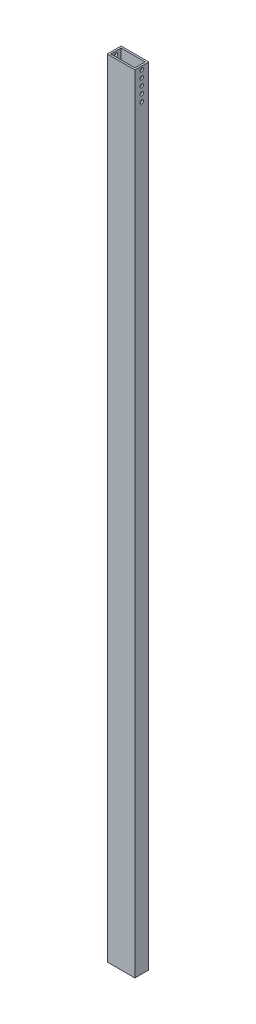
ISO-10303-21;
HEADER;
FILE_DESCRIPTION(('STEP AP214'),'2;1');
FILE_NAME('part.step','',(''),(''),'','','');
FILE_SCHEMA(('AUTOMOTIVE_DESIGN { 1 0 10303 214 1 1 1 1 }'));
ENDSEC;
DATA;
#1=APPLICATION_CONTEXT('core data for automotive mechanical design processes');
#2=APPLICATION_PROTOCOL_DEFINITION('international standard','automotive_design',2000,#1);
#3=PRODUCT_CONTEXT('',#1,'mechanical');
#4=PRODUCT('Part','Part','',(#3));
#5=PRODUCT_RELATED_PRODUCT_CATEGORY('part','',(#4));
#6=PRODUCT_DEFINITION_FORMATION('','',#4);
#7=PRODUCT_DEFINITION_CONTEXT('part definition',#1,'design');
#8=PRODUCT_DEFINITION('design','',#6,#7);
#9=PRODUCT_DEFINITION_SHAPE('','',#8);
#10=(LENGTH_UNIT() NAMED_UNIT(*) SI_UNIT(.MILLI.,.METRE.));
#11=(NAMED_UNIT(*) PLANE_ANGLE_UNIT() SI_UNIT($,.RADIAN.));
#12=(NAMED_UNIT(*) SI_UNIT($,.STERADIAN.) SOLID_ANGLE_UNIT());
#13=UNCERTAINTY_MEASURE_WITH_UNIT(LENGTH_MEASURE(1.E-05),#10,'distance_accuracy_value','');
#14=(GEOMETRIC_REPRESENTATION_CONTEXT(3) GLOBAL_UNCERTAINTY_ASSIGNED_CONTEXT((#13)) GLOBAL_UNIT_ASSIGNED_CONTEXT((#10,
#11,#12)) REPRESENTATION_CONTEXT('',''));
#15=CARTESIAN_POINT('',(0.,0.,0.));
#16=DIRECTION('',(0.,0.,1.));
#17=DIRECTION('',(1.,0.,0.));
#18=AXIS2_PLACEMENT_3D('',#15,#16,#17);
#19=CARTESIAN_POINT('',(0.,1447.8,0.));
#20=DIRECTION('',(0.,1.,0.));
#21=DIRECTION('',(0.,0.,1.));
#22=AXIS2_PLACEMENT_3D('',#19,#20,#21);
#23=PLANE('',#22);
#24=DIRECTION('',(0.,0.,1.));
#25=VECTOR('',#24,1.);
#26=CARTESIAN_POINT('',(-25.4,1447.8,12.7));
#27=LINE('',#26,#25);
#28=CARTESIAN_POINT('',(-25.4,1447.8,-12.7));
#29=VERTEX_POINT('',#28);
#30=CARTESIAN_POINT('',(-25.4,1447.8,12.7));
#31=VERTEX_POINT('',#30);
#32=EDGE_CURVE('E139',#29,#31,#27,.T.);
#33=ORIENTED_EDGE('',*,*,#32,.T.);
#34=DIRECTION('',(1.,0.,0.));
#35=VECTOR('',#34,1.);
#36=CARTESIAN_POINT('',(25.4,1447.8,12.7));
#37=LINE('',#36,#35);
#38=CARTESIAN_POINT('',(25.4,1447.8,12.7));
#39=VERTEX_POINT('',#38);
#40=EDGE_CURVE('E142',#31,#39,#37,.T.);
#41=ORIENTED_EDGE('',*,*,#40,.T.);
#42=DIRECTION('',(0.,0.,-1.));
#43=VECTOR('',#42,1.);
#44=CARTESIAN_POINT('',(25.4,1447.8,12.7));
#45=LINE('',#44,#43);
#46=CARTESIAN_POINT('',(25.4,1447.8,-12.7));
#47=VERTEX_POINT('',#46);
#48=EDGE_CURVE('E145',#39,#47,#45,.T.);
#49=ORIENTED_EDGE('',*,*,#48,.T.);
#50=DIRECTION('',(-1.,0.,0.));
#51=VECTOR('',#50,1.);
#52=CARTESIAN_POINT('',(25.4,1447.8,-12.7));
#53=LINE('',#52,#51);
#54=EDGE_CURVE('E147',#47,#29,#53,.T.);
#55=ORIENTED_EDGE('',*,*,#54,.T.);
#56=EDGE_LOOP('',(#33,#41,#49,#55));
#57=FACE_BOUND('',#56,.T.);
#58=DIRECTION('',(1.,0.,0.));
#59=VECTOR('',#58,1.);
#60=CARTESIAN_POINT('',(22.225,1447.8,9.525));
#61=LINE('',#60,#59);
#62=CARTESIAN_POINT('',(-22.225,1447.8,9.525));
#63=VERTEX_POINT('',#62);
#64=CARTESIAN_POINT('',(22.225,1447.8,9.525));
#65=VERTEX_POINT('',#64);
#66=EDGE_CURVE('E109',#63,#65,#61,.T.);
#67=ORIENTED_EDGE('',*,*,#66,.F.);
#68=DIRECTION('',(0.,0.,1.));
#69=VECTOR('',#68,1.);
#70=CARTESIAN_POINT('',(-22.225,1447.8,9.525));
#71=LINE('',#70,#69);
#72=CARTESIAN_POINT('',(-22.225,1447.8,-9.525));
#73=VERTEX_POINT('',#72);
#74=EDGE_CURVE('E100',#73,#63,#71,.T.);
#75=ORIENTED_EDGE('',*,*,#74,.F.);
#76=DIRECTION('',(-1.,0.,0.));
#77=VECTOR('',#76,1.);
#78=CARTESIAN_POINT('',(22.225,1447.8,-9.525));
#79=LINE('',#78,#77);
#80=CARTESIAN_POINT('',(22.225,1447.8,-9.525));
#81=VERTEX_POINT('',#80);
#82=EDGE_CURVE('E123',#81,#73,#79,.T.);
#83=ORIENTED_EDGE('',*,*,#82,.F.);
#84=DIRECTION('',(0.,0.,-1.));
#85=VECTOR('',#84,1.);
#86=CARTESIAN_POINT('',(22.225,1447.8,9.525));
#87=LINE('',#86,#85);
#88=EDGE_CURVE('E121',#65,#81,#87,.T.);
#89=ORIENTED_EDGE('',*,*,#88,.F.);
#90=EDGE_LOOP('',(#67,#75,#83,#89));
#91=FACE_BOUND('',#90,.T.);
#92=ADVANCED_FACE('F35',(#57,#91),#23,.T.);
#93=CARTESIAN_POINT('',(0.,0.,0.));
#94=DIRECTION('',(0.,1.,0.));
#95=DIRECTION('',(0.,0.,1.));
#96=AXIS2_PLACEMENT_3D('',#93,#94,#95);
#97=PLANE('',#96);
#98=DIRECTION('',(0.,0.,1.));
#99=VECTOR('',#98,1.);
#100=CARTESIAN_POINT('',(-25.4,0.,12.7));
#101=LINE('',#100,#99);
#102=CARTESIAN_POINT('',(-25.4,0.,-12.7));
#103=VERTEX_POINT('',#102);
#104=CARTESIAN_POINT('',(-25.4,0.,12.7));
#105=VERTEX_POINT('',#104);
#106=EDGE_CURVE('E117',#103,#105,#101,.T.);
#107=ORIENTED_EDGE('',*,*,#106,.F.);
#108=DIRECTION('',(-1.,0.,0.));
#109=VECTOR('',#108,1.);
#110=CARTESIAN_POINT('',(25.4,0.,-12.7));
#111=LINE('',#110,#109);
#112=CARTESIAN_POINT('',(25.4,0.,-12.7));
#113=VERTEX_POINT('',#112);
#114=EDGE_CURVE('E143',#113,#103,#111,.T.);
#115=ORIENTED_EDGE('',*,*,#114,.F.);
#116=DIRECTION('',(0.,0.,-1.));
#117=VECTOR('',#116,1.);
#118=CARTESIAN_POINT('',(25.4,0.,12.7));
#119=LINE('',#118,#117);
#120=CARTESIAN_POINT('',(25.4,0.,12.7));
#121=VERTEX_POINT('',#120);
#122=EDGE_CURVE('E154',#121,#113,#119,.T.);
#123=ORIENTED_EDGE('',*,*,#122,.F.);
#124=DIRECTION('',(1.,0.,0.));
#125=VECTOR('',#124,1.);
#126=CARTESIAN_POINT('',(25.4,0.,12.7));
#127=LINE('',#126,#125);
#128=EDGE_CURVE('E152',#105,#121,#127,.T.);
#129=ORIENTED_EDGE('',*,*,#128,.F.);
#130=EDGE_LOOP('',(#107,#115,#123,#129));
#131=FACE_BOUND('',#130,.T.);
#132=DIRECTION('',(0.,0.,1.));
#133=VECTOR('',#132,1.);
#134=CARTESIAN_POINT('',(-22.225,0.,9.525));
#135=LINE('',#134,#133);
#136=CARTESIAN_POINT('',(-22.225,0.,-9.525));
#137=VERTEX_POINT('',#136);
#138=CARTESIAN_POINT('',(-22.225,0.,9.525));
#139=VERTEX_POINT('',#138);
#140=EDGE_CURVE('E58',#137,#139,#135,.T.);
#141=ORIENTED_EDGE('',*,*,#140,.T.);
#142=DIRECTION('',(1.,0.,0.));
#143=VECTOR('',#142,1.);
#144=CARTESIAN_POINT('',(22.225,0.,9.525));
#145=LINE('',#144,#143);
#146=CARTESIAN_POINT('',(22.225,0.,9.525));
#147=VERTEX_POINT('',#146);
#148=EDGE_CURVE('E116',#139,#147,#145,.T.);
#149=ORIENTED_EDGE('',*,*,#148,.T.);
#150=DIRECTION('',(0.,0.,-1.));
#151=VECTOR('',#150,1.);
#152=CARTESIAN_POINT('',(22.225,0.,9.525));
#153=LINE('',#152,#151);
#154=CARTESIAN_POINT('',(22.225,0.,-9.525));
#155=VERTEX_POINT('',#154);
#156=EDGE_CURVE('E131',#147,#155,#153,.T.);
#157=ORIENTED_EDGE('',*,*,#156,.T.);
#158=DIRECTION('',(-1.,0.,0.));
#159=VECTOR('',#158,1.);
#160=CARTESIAN_POINT('',(22.225,0.,-9.525));
#161=LINE('',#160,#159);
#162=EDGE_CURVE('E110',#155,#137,#161,.T.);
#163=ORIENTED_EDGE('',*,*,#162,.T.);
#164=EDGE_LOOP('',(#141,#149,#157,#163));
#165=FACE_BOUND('',#164,.T.);
#166=ADVANCED_FACE('F222',(#131,#165),#97,.F.);
#167=CARTESIAN_POINT('',(-25.4,1447.8,12.7));
#168=DIRECTION('',(1.,0.,0.));
#169=DIRECTION('',(0.,0.,-1.));
#170=AXIS2_PLACEMENT_3D('',#167,#168,#169);
#171=PLANE('',#170);
#172=CARTESIAN_POINT('',(-25.4,1428.75,0.));
#173=DIRECTION('',(1.,0.,0.));
#174=DIRECTION('',(0.,0.,-1.));
#175=AXIS2_PLACEMENT_3D('',#172,#173,#174);
#176=CIRCLE('',#175,3.17500000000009);
#177=CARTESIAN_POINT('',(-25.4,1428.75,-3.17500000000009));
#178=VERTEX_POINT('',#177);
#179=EDGE_CURVE('E314',#178,#178,#176,.T.);
#180=ORIENTED_EDGE('',*,*,#179,.T.);
#181=EDGE_LOOP('',(#180));
#182=FACE_BOUND('',#181,.T.);
#183=CARTESIAN_POINT('',(-25.4,1441.45,0.));
#184=DIRECTION('',(1.,0.,0.));
#185=DIRECTION('',(0.,0.,-1.));
#186=AXIS2_PLACEMENT_3D('',#183,#184,#185);
#187=CIRCLE('',#186,3.17500000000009);
#188=CARTESIAN_POINT('',(-25.4,1441.45,-3.17500000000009));
#189=VERTEX_POINT('',#188);
#190=EDGE_CURVE('E172',#189,#189,#187,.T.);
#191=ORIENTED_EDGE('',*,*,#190,.T.);
#192=EDGE_LOOP('',(#191));
#193=FACE_BOUND('',#192,.T.);
#194=ORIENTED_EDGE('',*,*,#106,.T.);
#195=DIRECTION('',(0.,-1.,0.));
#196=VECTOR('',#195,1.);
#197=CARTESIAN_POINT('',(-25.4,1447.8,12.7));
#198=LINE('',#197,#196);
#199=EDGE_CURVE('E165',#31,#105,#198,.T.);
#200=ORIENTED_EDGE('',*,*,#199,.F.);
#201=ORIENTED_EDGE('',*,*,#32,.F.);
#202=DIRECTION('',(0.,-1.,0.));
#203=VECTOR('',#202,1.);
#204=CARTESIAN_POINT('',(-25.4,1447.8,-12.7));
#205=LINE('',#204,#203);
#206=EDGE_CURVE('E149',#29,#103,#205,.T.);
#207=ORIENTED_EDGE('',*,*,#206,.T.);
#208=EDGE_LOOP('',(#194,#200,#201,#207));
#209=FACE_BOUND('',#208,.T.);
#210=CARTESIAN_POINT('',(-25.4,1416.05,0.));
#211=DIRECTION('',(1.,0.,0.));
#212=DIRECTION('',(0.,0.,-1.));
#213=AXIS2_PLACEMENT_3D('',#210,#211,#212);
#214=CIRCLE('',#213,3.17500000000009);
#215=CARTESIAN_POINT('',(-25.4,1416.05,-3.17500000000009));
#216=VERTEX_POINT('',#215);
#217=EDGE_CURVE('E175',#216,#216,#214,.T.);
#218=ORIENTED_EDGE('',*,*,#217,.T.);
#219=EDGE_LOOP('',(#218));
#220=FACE_BOUND('',#219,.T.);
#221=CARTESIAN_POINT('',(-25.4,1403.35,0.));
#222=DIRECTION('',(1.,0.,0.));
#223=DIRECTION('',(0.,0.,-1.));
#224=AXIS2_PLACEMENT_3D('',#221,#222,#223);
#225=CIRCLE('',#224,3.17500000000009);
#226=CARTESIAN_POINT('',(-25.4,1403.35,-3.17500000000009));
#227=VERTEX_POINT('',#226);
#228=EDGE_CURVE('E181',#227,#227,#225,.T.);
#229=ORIENTED_EDGE('',*,*,#228,.T.);
#230=EDGE_LOOP('',(#229));
#231=FACE_BOUND('',#230,.T.);
#232=CARTESIAN_POINT('',(-25.4,1390.65,0.));
#233=DIRECTION('',(1.,0.,0.));
#234=DIRECTION('',(0.,0.,-1.));
#235=AXIS2_PLACEMENT_3D('',#232,#233,#234);
#236=CIRCLE('',#235,3.17500000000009);
#237=CARTESIAN_POINT('',(-25.4,1390.65,-3.17500000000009));
#238=VERTEX_POINT('',#237);
#239=EDGE_CURVE('E187',#238,#238,#236,.T.);
#240=ORIENTED_EDGE('',*,*,#239,.T.);
#241=EDGE_LOOP('',(#240));
#242=FACE_BOUND('',#241,.T.);
#243=ADVANCED_FACE('F228',(#182,#193,#209,#220,#231,#242),#171,.F.);
#244=CARTESIAN_POINT('',(25.4,1447.8,12.7));
#245=DIRECTION('',(0.,0.,-1.));
#246=DIRECTION('',(-1.,0.,0.));
#247=AXIS2_PLACEMENT_3D('',#244,#245,#246);
#248=PLANE('',#247);
#249=ORIENTED_EDGE('',*,*,#128,.T.);
#250=DIRECTION('',(0.,-1.,0.));
#251=VECTOR('',#250,1.);
#252=CARTESIAN_POINT('',(25.4,1447.8,12.7));
#253=LINE('',#252,#251);
#254=EDGE_CURVE('E162',#39,#121,#253,.T.);
#255=ORIENTED_EDGE('',*,*,#254,.F.);
#256=ORIENTED_EDGE('',*,*,#40,.F.);
#257=ORIENTED_EDGE('',*,*,#199,.T.);
#258=EDGE_LOOP('',(#249,#255,#256,#257));
#259=FACE_BOUND('',#258,.T.);
#260=ADVANCED_FACE('F240',(#259),#248,.F.);
#261=CARTESIAN_POINT('',(25.4,1447.8,12.7));
#262=DIRECTION('',(-1.,0.,0.));
#263=DIRECTION('',(0.,0.,1.));
#264=AXIS2_PLACEMENT_3D('',#261,#262,#263);
#265=PLANE('',#264);
#266=CARTESIAN_POINT('',(25.4,1428.75,0.));
#267=DIRECTION('',(1.,0.,0.));
#268=DIRECTION('',(0.,0.,-1.));
#269=AXIS2_PLACEMENT_3D('',#266,#267,#268);
#270=CIRCLE('',#269,3.17500000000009);
#271=CARTESIAN_POINT('',(25.4,1428.75,-3.17500000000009));
#272=VERTEX_POINT('',#271);
#273=EDGE_CURVE('E331',#272,#272,#270,.T.);
#274=ORIENTED_EDGE('',*,*,#273,.F.);
#275=EDGE_LOOP('',(#274));
#276=FACE_BOUND('',#275,.T.);
#277=CARTESIAN_POINT('',(25.4,1441.45,0.));
#278=DIRECTION('',(1.,0.,0.));
#279=DIRECTION('',(0.,0.,-1.));
#280=AXIS2_PLACEMENT_3D('',#277,#278,#279);
#281=CIRCLE('',#280,3.17500000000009);
#282=CARTESIAN_POINT('',(25.4,1441.45,-3.17500000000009));
#283=VERTEX_POINT('',#282);
#284=EDGE_CURVE('E312',#283,#283,#281,.T.);
#285=ORIENTED_EDGE('',*,*,#284,.F.);
#286=EDGE_LOOP('',(#285));
#287=FACE_BOUND('',#286,.T.);
#288=ORIENTED_EDGE('',*,*,#122,.T.);
#289=DIRECTION('',(0.,-1.,0.));
#290=VECTOR('',#289,1.);
#291=CARTESIAN_POINT('',(25.4,1447.8,-12.7));
#292=LINE('',#291,#290);
#293=EDGE_CURVE('E159',#47,#113,#292,.T.);
#294=ORIENTED_EDGE('',*,*,#293,.F.);
#295=ORIENTED_EDGE('',*,*,#48,.F.);
#296=ORIENTED_EDGE('',*,*,#254,.T.);
#297=EDGE_LOOP('',(#288,#294,#295,#296));
#298=FACE_BOUND('',#297,.T.);
#299=CARTESIAN_POINT('',(25.4,1416.05,0.));
#300=DIRECTION('',(1.,0.,0.));
#301=DIRECTION('',(0.,0.,-1.));
#302=AXIS2_PLACEMENT_3D('',#299,#300,#301);
#303=CIRCLE('',#302,3.17500000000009);
#304=CARTESIAN_POINT('',(25.4,1416.05,-3.17500000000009));
#305=VERTEX_POINT('',#304);
#306=EDGE_CURVE('E193',#305,#305,#303,.T.);
#307=ORIENTED_EDGE('',*,*,#306,.F.);
#308=EDGE_LOOP('',(#307));
#309=FACE_BOUND('',#308,.T.);
#310=CARTESIAN_POINT('',(25.4,1403.35,0.));
#311=DIRECTION('',(1.,0.,0.));
#312=DIRECTION('',(0.,0.,-1.));
#313=AXIS2_PLACEMENT_3D('',#310,#311,#312);
#314=CIRCLE('',#313,3.17500000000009);
#315=CARTESIAN_POINT('',(25.4,1403.35,-3.17500000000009));
#316=VERTEX_POINT('',#315);
#317=EDGE_CURVE('E199',#316,#316,#314,.T.);
#318=ORIENTED_EDGE('',*,*,#317,.F.);
#319=EDGE_LOOP('',(#318));
#320=FACE_BOUND('',#319,.T.);
#321=CARTESIAN_POINT('',(25.4,1390.65,0.));
#322=DIRECTION('',(1.,0.,0.));
#323=DIRECTION('',(0.,0.,-1.));
#324=AXIS2_PLACEMENT_3D('',#321,#322,#323);
#325=CIRCLE('',#324,3.17500000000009);
#326=CARTESIAN_POINT('',(25.4,1390.65,-3.17500000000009));
#327=VERTEX_POINT('',#326);
#328=EDGE_CURVE('E11',#327,#327,#325,.T.);
#329=ORIENTED_EDGE('',*,*,#328,.F.);
#330=EDGE_LOOP('',(#329));
#331=FACE_BOUND('',#330,.T.);
#332=ADVANCED_FACE('F236',(#276,#287,#298,#309,#320,#331),#265,.F.);
#333=CARTESIAN_POINT('',(25.4,1447.8,-12.7));
#334=DIRECTION('',(0.,0.,1.));
#335=DIRECTION('',(1.,0.,0.));
#336=AXIS2_PLACEMENT_3D('',#333,#334,#335);
#337=PLANE('',#336);
#338=CARTESIAN_POINT('',(13.1518559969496,708.031280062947,-12.7));
#339=DIRECTION('',(0.,0.,-1.));
#340=DIRECTION('',(-1.,0.,0.));
#341=AXIS2_PLACEMENT_3D('',#338,#339,#340);
#342=CIRCLE('',#341,3.17500000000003);
#343=CARTESIAN_POINT('',(9.97685599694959,708.031280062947,-12.7));
#344=VERTEX_POINT('',#343);
#345=EDGE_CURVE('E361',#344,#344,#342,.T.);
#346=ORIENTED_EDGE('',*,*,#345,.F.);
#347=EDGE_LOOP('',(#346));
#348=FACE_BOUND('',#347,.T.);
#349=CARTESIAN_POINT('',(13.1518559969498,720.731280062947,-12.7));
#350=DIRECTION('',(0.,0.,-1.));
#351=DIRECTION('',(-1.,0.,0.));
#352=AXIS2_PLACEMENT_3D('',#349,#350,#351);
#353=CIRCLE('',#352,3.17499999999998);
#354=CARTESIAN_POINT('',(9.97685599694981,720.731280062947,-12.7));
#355=VERTEX_POINT('',#354);
#356=EDGE_CURVE('E355',#355,#355,#353,.T.);
#357=ORIENTED_EDGE('',*,*,#356,.F.);
#358=EDGE_LOOP('',(#357));
#359=FACE_BOUND('',#358,.T.);
#360=CARTESIAN_POINT('',(13.1518559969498,733.431280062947,-12.7));
#361=DIRECTION('',(0.,0.,-1.));
#362=DIRECTION('',(-1.,0.,0.));
#363=AXIS2_PLACEMENT_3D('',#360,#361,#362);
#364=CIRCLE('',#363,3.17499999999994);
#365=CARTESIAN_POINT('',(9.97685599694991,733.431280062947,-12.7));
#366=VERTEX_POINT('',#365);
#367=EDGE_CURVE('E349',#366,#366,#364,.T.);
#368=ORIENTED_EDGE('',*,*,#367,.F.);
#369=EDGE_LOOP('',(#368));
#370=FACE_BOUND('',#369,.T.);
#371=CARTESIAN_POINT('',(13.1518559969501,746.131280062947,-12.7));
#372=DIRECTION('',(0.,0.,-1.));
#373=DIRECTION('',(-1.,0.,0.));
#374=AXIS2_PLACEMENT_3D('',#371,#372,#373);
#375=CIRCLE('',#374,3.17499999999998);
#376=CARTESIAN_POINT('',(9.97685599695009,746.131280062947,-12.7));
#377=VERTEX_POINT('',#376);
#378=EDGE_CURVE('E343',#377,#377,#375,.T.);
#379=ORIENTED_EDGE('',*,*,#378,.F.);
#380=EDGE_LOOP('',(#379));
#381=FACE_BOUND('',#380,.T.);
#382=CARTESIAN_POINT('',(13.1518559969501,758.831280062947,-12.7));
#383=DIRECTION('',(0.,0.,-1.));
#384=DIRECTION('',(-1.,0.,0.));
#385=AXIS2_PLACEMENT_3D('',#382,#383,#384);
#386=CIRCLE('',#385,3.17499999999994);
#387=CARTESIAN_POINT('',(9.97685599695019,758.831280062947,-12.7));
#388=VERTEX_POINT('',#387);
#389=EDGE_CURVE('E339',#388,#388,#386,.T.);
#390=ORIENTED_EDGE('',*,*,#389,.F.);
#391=EDGE_LOOP('',(#390));
#392=FACE_BOUND('',#391,.T.);
#393=ORIENTED_EDGE('',*,*,#114,.T.);
#394=ORIENTED_EDGE('',*,*,#206,.F.);
#395=ORIENTED_EDGE('',*,*,#54,.F.);
#396=ORIENTED_EDGE('',*,*,#293,.T.);
#397=EDGE_LOOP('',(#393,#394,#395,#396));
#398=FACE_BOUND('',#397,.T.);
#399=ADVANCED_FACE('F233',(#348,#359,#370,#381,#392,#398),#337,.F.);
#400=CARTESIAN_POINT('',(-22.225,1447.8,9.525));
#401=DIRECTION('',(1.,0.,0.));
#402=DIRECTION('',(0.,0.,-1.));
#403=AXIS2_PLACEMENT_3D('',#400,#401,#402);
#404=PLANE('',#403);
#405=CARTESIAN_POINT('',(-22.225,1428.75,0.));
#406=DIRECTION('',(1.,0.,0.));
#407=DIRECTION('',(0.,0.,-1.));
#408=AXIS2_PLACEMENT_3D('',#405,#406,#407);
#409=CIRCLE('',#408,3.17500000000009);
#410=CARTESIAN_POINT('',(-22.225,1428.75,-3.17500000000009));
#411=VERTEX_POINT('',#410);
#412=EDGE_CURVE('E319',#411,#411,#409,.T.);
#413=ORIENTED_EDGE('',*,*,#412,.F.);
#414=EDGE_LOOP('',(#413));
#415=FACE_BOUND('',#414,.T.);
#416=CARTESIAN_POINT('',(-22.225,1441.45,0.));
#417=DIRECTION('',(1.,0.,0.));
#418=DIRECTION('',(0.,0.,-1.));
#419=AXIS2_PLACEMENT_3D('',#416,#417,#418);
#420=CIRCLE('',#419,3.17500000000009);
#421=CARTESIAN_POINT('',(-22.225,1441.45,-3.17500000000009));
#422=VERTEX_POINT('',#421);
#423=EDGE_CURVE('E129',#422,#422,#420,.T.);
#424=ORIENTED_EDGE('',*,*,#423,.F.);
#425=EDGE_LOOP('',(#424));
#426=FACE_BOUND('',#425,.T.);
#427=ORIENTED_EDGE('',*,*,#140,.F.);
#428=DIRECTION('',(0.,-1.,0.));
#429=VECTOR('',#428,1.);
#430=CARTESIAN_POINT('',(-22.225,1447.8,-9.525));
#431=LINE('',#430,#429);
#432=EDGE_CURVE('E105',#73,#137,#431,.T.);
#433=ORIENTED_EDGE('',*,*,#432,.F.);
#434=ORIENTED_EDGE('',*,*,#74,.T.);
#435=DIRECTION('',(0.,-1.,0.));
#436=VECTOR('',#435,1.);
#437=CARTESIAN_POINT('',(-22.225,1447.8,9.525));
#438=LINE('',#437,#436);
#439=EDGE_CURVE('E104',#63,#139,#438,.T.);
#440=ORIENTED_EDGE('',*,*,#439,.T.);
#441=EDGE_LOOP('',(#427,#433,#434,#440));
#442=FACE_BOUND('',#441,.T.);
#443=CARTESIAN_POINT('',(-22.225,1416.05,0.));
#444=DIRECTION('',(1.,0.,0.));
#445=DIRECTION('',(0.,0.,-1.));
#446=AXIS2_PLACEMENT_3D('',#443,#444,#445);
#447=CIRCLE('',#446,3.17500000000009);
#448=CARTESIAN_POINT('',(-22.225,1416.05,-3.17500000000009));
#449=VERTEX_POINT('',#448);
#450=EDGE_CURVE('E168',#449,#449,#447,.T.);
#451=ORIENTED_EDGE('',*,*,#450,.F.);
#452=EDGE_LOOP('',(#451));
#453=FACE_BOUND('',#452,.T.);
#454=CARTESIAN_POINT('',(-22.225,1403.35,0.));
#455=DIRECTION('',(1.,0.,0.));
#456=DIRECTION('',(0.,0.,-1.));
#457=AXIS2_PLACEMENT_3D('',#454,#455,#456);
#458=CIRCLE('',#457,3.17500000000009);
#459=CARTESIAN_POINT('',(-22.225,1403.35,-3.17500000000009));
#460=VERTEX_POINT('',#459);
#461=EDGE_CURVE('E178',#460,#460,#458,.T.);
#462=ORIENTED_EDGE('',*,*,#461,.F.);
#463=EDGE_LOOP('',(#462));
#464=FACE_BOUND('',#463,.T.);
#465=CARTESIAN_POINT('',(-22.225,1390.65,0.));
#466=DIRECTION('',(1.,0.,0.));
#467=DIRECTION('',(0.,0.,-1.));
#468=AXIS2_PLACEMENT_3D('',#465,#466,#467);
#469=CIRCLE('',#468,3.17500000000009);
#470=CARTESIAN_POINT('',(-22.225,1390.65,-3.17500000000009));
#471=VERTEX_POINT('',#470);
#472=EDGE_CURVE('E184',#471,#471,#469,.T.);
#473=ORIENTED_EDGE('',*,*,#472,.F.);
#474=EDGE_LOOP('',(#473));
#475=FACE_BOUND('',#474,.T.);
#476=ADVANCED_FACE('F102',(#415,#426,#442,#453,#464,#475),#404,.T.);
#477=CARTESIAN_POINT('',(22.225,1447.8,9.525));
#478=DIRECTION('',(0.,0.,-1.));
#479=DIRECTION('',(-1.,0.,0.));
#480=AXIS2_PLACEMENT_3D('',#477,#478,#479);
#481=PLANE('',#480);
#482=ORIENTED_EDGE('',*,*,#148,.F.);
#483=ORIENTED_EDGE('',*,*,#439,.F.);
#484=ORIENTED_EDGE('',*,*,#66,.T.);
#485=DIRECTION('',(0.,-1.,0.));
#486=VECTOR('',#485,1.);
#487=CARTESIAN_POINT('',(22.225,1447.8,9.525));
#488=LINE('',#487,#486);
#489=EDGE_CURVE('E118',#65,#147,#488,.T.);
#490=ORIENTED_EDGE('',*,*,#489,.T.);
#491=EDGE_LOOP('',(#482,#483,#484,#490));
#492=FACE_BOUND('',#491,.T.);
#493=ADVANCED_FACE('F113',(#492),#481,.T.);
#494=CARTESIAN_POINT('',(22.225,1447.8,9.525));
#495=DIRECTION('',(-1.,0.,0.));
#496=DIRECTION('',(0.,0.,1.));
#497=AXIS2_PLACEMENT_3D('',#494,#495,#496);
#498=PLANE('',#497);
#499=CARTESIAN_POINT('',(22.225,1428.75,0.));
#500=DIRECTION('',(-1.,0.,0.));
#501=DIRECTION('',(0.,0.,1.));
#502=AXIS2_PLACEMENT_3D('',#499,#500,#501);
#503=CIRCLE('',#502,3.17500000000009);
#504=CARTESIAN_POINT('',(22.225,1428.75,3.17500000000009));
#505=VERTEX_POINT('',#504);
#506=EDGE_CURVE('E334',#505,#505,#503,.T.);
#507=ORIENTED_EDGE('',*,*,#506,.F.);
#508=EDGE_LOOP('',(#507));
#509=FACE_BOUND('',#508,.T.);
#510=CARTESIAN_POINT('',(22.225,1441.45,0.));
#511=DIRECTION('',(-1.,0.,0.));
#512=DIRECTION('',(0.,0.,1.));
#513=AXIS2_PLACEMENT_3D('',#510,#511,#512);
#514=CIRCLE('',#513,3.17500000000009);
#515=CARTESIAN_POINT('',(22.225,1441.45,3.17500000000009));
#516=VERTEX_POINT('',#515);
#517=EDGE_CURVE('E169',#516,#516,#514,.T.);
#518=ORIENTED_EDGE('',*,*,#517,.F.);
#519=EDGE_LOOP('',(#518));
#520=FACE_BOUND('',#519,.T.);
#521=ORIENTED_EDGE('',*,*,#156,.F.);
#522=ORIENTED_EDGE('',*,*,#489,.F.);
#523=ORIENTED_EDGE('',*,*,#88,.T.);
#524=DIRECTION('',(0.,-1.,0.));
#525=VECTOR('',#524,1.);
#526=CARTESIAN_POINT('',(22.225,1447.8,-9.525));
#527=LINE('',#526,#525);
#528=EDGE_CURVE('E50',#81,#155,#527,.T.);
#529=ORIENTED_EDGE('',*,*,#528,.T.);
#530=EDGE_LOOP('',(#521,#522,#523,#529));
#531=FACE_BOUND('',#530,.T.);
#532=CARTESIAN_POINT('',(22.225,1416.05,0.));
#533=DIRECTION('',(-1.,0.,0.));
#534=DIRECTION('',(0.,0.,1.));
#535=AXIS2_PLACEMENT_3D('',#532,#533,#534);
#536=CIRCLE('',#535,3.17500000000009);
#537=CARTESIAN_POINT('',(22.225,1416.05,3.17500000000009));
#538=VERTEX_POINT('',#537);
#539=EDGE_CURVE('E190',#538,#538,#536,.T.);
#540=ORIENTED_EDGE('',*,*,#539,.F.);
#541=EDGE_LOOP('',(#540));
#542=FACE_BOUND('',#541,.T.);
#543=CARTESIAN_POINT('',(22.225,1403.35,0.));
#544=DIRECTION('',(-1.,0.,0.));
#545=DIRECTION('',(0.,0.,1.));
#546=AXIS2_PLACEMENT_3D('',#543,#544,#545);
#547=CIRCLE('',#546,3.17500000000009);
#548=CARTESIAN_POINT('',(22.225,1403.35,3.17500000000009));
#549=VERTEX_POINT('',#548);
#550=EDGE_CURVE('E196',#549,#549,#547,.T.);
#551=ORIENTED_EDGE('',*,*,#550,.F.);
#552=EDGE_LOOP('',(#551));
#553=FACE_BOUND('',#552,.T.);
#554=CARTESIAN_POINT('',(22.225,1390.65,0.));
#555=DIRECTION('',(-1.,0.,0.));
#556=DIRECTION('',(0.,0.,1.));
#557=AXIS2_PLACEMENT_3D('',#554,#555,#556);
#558=CIRCLE('',#557,3.17500000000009);
#559=CARTESIAN_POINT('',(22.225,1390.65,3.17500000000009));
#560=VERTEX_POINT('',#559);
#561=EDGE_CURVE('E43',#560,#560,#558,.T.);
#562=ORIENTED_EDGE('',*,*,#561,.F.);
#563=EDGE_LOOP('',(#562));
#564=FACE_BOUND('',#563,.T.);
#565=ADVANCED_FACE('F206',(#509,#520,#531,#542,#553,#564),#498,.T.);
#566=CARTESIAN_POINT('',(22.225,1447.8,-9.525));
#567=DIRECTION('',(0.,0.,1.));
#568=DIRECTION('',(1.,0.,0.));
#569=AXIS2_PLACEMENT_3D('',#566,#567,#568);
#570=PLANE('',#569);
#571=CARTESIAN_POINT('',(13.1518559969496,708.031280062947,-9.525));
#572=DIRECTION('',(0.,0.,1.));
#573=DIRECTION('',(1.,0.,0.));
#574=AXIS2_PLACEMENT_3D('',#571,#572,#573);
#575=CIRCLE('',#574,3.17500000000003);
#576=CARTESIAN_POINT('',(9.97685599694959,708.031280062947,-9.525));
#577=VERTEX_POINT('',#576);
#578=EDGE_CURVE('E364',#577,#577,#575,.F.);
#579=ORIENTED_EDGE('',*,*,#578,.T.);
#580=EDGE_LOOP('',(#579));
#581=FACE_BOUND('',#580,.T.);
#582=CARTESIAN_POINT('',(13.1518559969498,720.731280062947,-9.525));
#583=DIRECTION('',(0.,0.,1.));
#584=DIRECTION('',(1.,0.,0.));
#585=AXIS2_PLACEMENT_3D('',#582,#583,#584);
#586=CIRCLE('',#585,3.17499999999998);
#587=CARTESIAN_POINT('',(9.97685599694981,720.731280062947,-9.525));
#588=VERTEX_POINT('',#587);
#589=EDGE_CURVE('E358',#588,#588,#586,.F.);
#590=ORIENTED_EDGE('',*,*,#589,.T.);
#591=EDGE_LOOP('',(#590));
#592=FACE_BOUND('',#591,.T.);
#593=CARTESIAN_POINT('',(13.1518559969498,733.431280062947,-9.525));
#594=DIRECTION('',(0.,0.,1.));
#595=DIRECTION('',(1.,0.,0.));
#596=AXIS2_PLACEMENT_3D('',#593,#594,#595);
#597=CIRCLE('',#596,3.17499999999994);
#598=CARTESIAN_POINT('',(9.97685599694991,733.431280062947,-9.525));
#599=VERTEX_POINT('',#598);
#600=EDGE_CURVE('E352',#599,#599,#597,.F.);
#601=ORIENTED_EDGE('',*,*,#600,.T.);
#602=EDGE_LOOP('',(#601));
#603=FACE_BOUND('',#602,.T.);
#604=CARTESIAN_POINT('',(13.1518559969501,746.131280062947,-9.525));
#605=DIRECTION('',(0.,0.,1.));
#606=DIRECTION('',(1.,0.,0.));
#607=AXIS2_PLACEMENT_3D('',#604,#605,#606);
#608=CIRCLE('',#607,3.17499999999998);
#609=CARTESIAN_POINT('',(9.97685599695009,746.131280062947,-9.525));
#610=VERTEX_POINT('',#609);
#611=EDGE_CURVE('E346',#610,#610,#608,.F.);
#612=ORIENTED_EDGE('',*,*,#611,.T.);
#613=EDGE_LOOP('',(#612));
#614=FACE_BOUND('',#613,.T.);
#615=CARTESIAN_POINT('',(13.1518559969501,758.831280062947,-9.525));
#616=DIRECTION('',(0.,0.,1.));
#617=DIRECTION('',(1.,0.,0.));
#618=AXIS2_PLACEMENT_3D('',#615,#616,#617);
#619=CIRCLE('',#618,3.17499999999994);
#620=CARTESIAN_POINT('',(9.97685599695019,758.831280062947,-9.525));
#621=VERTEX_POINT('',#620);
#622=EDGE_CURVE('E340',#621,#621,#619,.F.);
#623=ORIENTED_EDGE('',*,*,#622,.T.);
#624=EDGE_LOOP('',(#623));
#625=FACE_BOUND('',#624,.T.);
#626=ORIENTED_EDGE('',*,*,#162,.F.);
#627=ORIENTED_EDGE('',*,*,#528,.F.);
#628=ORIENTED_EDGE('',*,*,#82,.T.);
#629=ORIENTED_EDGE('',*,*,#432,.T.);
#630=EDGE_LOOP('',(#626,#627,#628,#629));
#631=FACE_BOUND('',#630,.T.);
#632=ADVANCED_FACE('F208',(#581,#592,#603,#614,#625,#631),#570,.T.);
#633=CARTESIAN_POINT('',(-25.4,1441.45,0.));
#634=DIRECTION('',(1.,0.,0.));
#635=DIRECTION('',(0.,0.,-1.));
#636=AXIS2_PLACEMENT_3D('',#633,#634,#635);
#637=CYLINDRICAL_SURFACE('',#636,3.17500000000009);
#638=ORIENTED_EDGE('',*,*,#517,.T.);
#639=EDGE_LOOP('',(#638));
#640=FACE_BOUND('',#639,.T.);
#641=ORIENTED_EDGE('',*,*,#284,.T.);
#642=EDGE_LOOP('',(#641));
#643=FACE_BOUND('',#642,.T.);
#644=ADVANCED_FACE('F215',(#640,#643),#637,.F.);
#645=ORIENTED_EDGE('',*,*,#423,.T.);
#646=EDGE_LOOP('',(#645));
#647=FACE_BOUND('',#646,.T.);
#648=ORIENTED_EDGE('',*,*,#190,.F.);
#649=EDGE_LOOP('',(#648));
#650=FACE_BOUND('',#649,.T.);
#651=ADVANCED_FACE('F300',(#647,#650),#637,.F.);
#652=CARTESIAN_POINT('',(-25.4,1428.75,0.));
#653=DIRECTION('',(1.,0.,0.));
#654=DIRECTION('',(0.,0.,-1.));
#655=AXIS2_PLACEMENT_3D('',#652,#653,#654);
#656=CYLINDRICAL_SURFACE('',#655,3.17500000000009);
#657=ORIENTED_EDGE('',*,*,#412,.T.);
#658=EDGE_LOOP('',(#657));
#659=FACE_BOUND('',#658,.T.);
#660=ORIENTED_EDGE('',*,*,#179,.F.);
#661=EDGE_LOOP('',(#660));
#662=FACE_BOUND('',#661,.T.);
#663=ADVANCED_FACE('F252',(#659,#662),#656,.F.);
#664=CARTESIAN_POINT('',(-25.4,1416.05,0.));
#665=DIRECTION('',(1.,0.,0.));
#666=DIRECTION('',(0.,0.,-1.));
#667=AXIS2_PLACEMENT_3D('',#664,#665,#666);
#668=CYLINDRICAL_SURFACE('',#667,3.17500000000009);
#669=ORIENTED_EDGE('',*,*,#450,.T.);
#670=EDGE_LOOP('',(#669));
#671=FACE_BOUND('',#670,.T.);
#672=ORIENTED_EDGE('',*,*,#217,.F.);
#673=EDGE_LOOP('',(#672));
#674=FACE_BOUND('',#673,.T.);
#675=ADVANCED_FACE('F248',(#671,#674),#668,.F.);
#676=CARTESIAN_POINT('',(-25.4,1403.35,0.));
#677=DIRECTION('',(1.,0.,0.));
#678=DIRECTION('',(0.,0.,-1.));
#679=AXIS2_PLACEMENT_3D('',#676,#677,#678);
#680=CYLINDRICAL_SURFACE('',#679,3.17500000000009);
#681=ORIENTED_EDGE('',*,*,#461,.T.);
#682=EDGE_LOOP('',(#681));
#683=FACE_BOUND('',#682,.T.);
#684=ORIENTED_EDGE('',*,*,#228,.F.);
#685=EDGE_LOOP('',(#684));
#686=FACE_BOUND('',#685,.T.);
#687=ADVANCED_FACE('F251',(#683,#686),#680,.F.);
#688=CARTESIAN_POINT('',(-25.4,1390.65,0.));
#689=DIRECTION('',(1.,0.,0.));
#690=DIRECTION('',(0.,0.,-1.));
#691=AXIS2_PLACEMENT_3D('',#688,#689,#690);
#692=CYLINDRICAL_SURFACE('',#691,3.17500000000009);
#693=ORIENTED_EDGE('',*,*,#472,.T.);
#694=EDGE_LOOP('',(#693));
#695=FACE_BOUND('',#694,.T.);
#696=ORIENTED_EDGE('',*,*,#239,.F.);
#697=EDGE_LOOP('',(#696));
#698=FACE_BOUND('',#697,.T.);
#699=ADVANCED_FACE('F256',(#695,#698),#692,.F.);
#700=CARTESIAN_POINT('',(-25.4,1428.75,0.));
#701=DIRECTION('',(1.,0.,0.));
#702=DIRECTION('',(0.,0.,-1.));
#703=AXIS2_PLACEMENT_3D('',#700,#701,#702);
#704=CYLINDRICAL_SURFACE('',#703,3.17500000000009);
#705=ORIENTED_EDGE('',*,*,#506,.T.);
#706=EDGE_LOOP('',(#705));
#707=FACE_BOUND('',#706,.T.);
#708=ORIENTED_EDGE('',*,*,#273,.T.);
#709=EDGE_LOOP('',(#708));
#710=FACE_BOUND('',#709,.T.);
#711=ADVANCED_FACE('F260',(#707,#710),#704,.F.);
#712=CARTESIAN_POINT('',(-25.4,1416.05,0.));
#713=DIRECTION('',(1.,0.,0.));
#714=DIRECTION('',(0.,0.,-1.));
#715=AXIS2_PLACEMENT_3D('',#712,#713,#714);
#716=CYLINDRICAL_SURFACE('',#715,3.17500000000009);
#717=ORIENTED_EDGE('',*,*,#539,.T.);
#718=EDGE_LOOP('',(#717));
#719=FACE_BOUND('',#718,.T.);
#720=ORIENTED_EDGE('',*,*,#306,.T.);
#721=EDGE_LOOP('',(#720));
#722=FACE_BOUND('',#721,.T.);
#723=ADVANCED_FACE('F262',(#719,#722),#716,.F.);
#724=CARTESIAN_POINT('',(-25.4,1403.35,0.));
#725=DIRECTION('',(1.,0.,0.));
#726=DIRECTION('',(0.,0.,-1.));
#727=AXIS2_PLACEMENT_3D('',#724,#725,#726);
#728=CYLINDRICAL_SURFACE('',#727,3.17500000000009);
#729=ORIENTED_EDGE('',*,*,#550,.T.);
#730=EDGE_LOOP('',(#729));
#731=FACE_BOUND('',#730,.T.);
#732=ORIENTED_EDGE('',*,*,#317,.T.);
#733=EDGE_LOOP('',(#732));
#734=FACE_BOUND('',#733,.T.);
#735=ADVANCED_FACE('F264',(#731,#734),#728,.F.);
#736=CARTESIAN_POINT('',(-25.4,1390.65,0.));
#737=DIRECTION('',(1.,0.,0.));
#738=DIRECTION('',(0.,0.,-1.));
#739=AXIS2_PLACEMENT_3D('',#736,#737,#738);
#740=CYLINDRICAL_SURFACE('',#739,3.17500000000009);
#741=ORIENTED_EDGE('',*,*,#561,.T.);
#742=EDGE_LOOP('',(#741));
#743=FACE_BOUND('',#742,.T.);
#744=ORIENTED_EDGE('',*,*,#328,.T.);
#745=EDGE_LOOP('',(#744));
#746=FACE_BOUND('',#745,.T.);
#747=ADVANCED_FACE('F37',(#743,#746),#740,.F.);
#748=CARTESIAN_POINT('',(13.1518559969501,758.831280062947,12.701));
#749=DIRECTION('',(0.,0.,-1.));
#750=DIRECTION('',(-1.,0.,0.));
#751=AXIS2_PLACEMENT_3D('',#748,#749,#750);
#752=CYLINDRICAL_SURFACE('',#751,3.17499999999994);
#753=CARTESIAN_POINT('',(9.97685599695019,758.831280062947,-9.525));
#754=CARTESIAN_POINT('',(9.97685599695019,758.831280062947,-9.55807291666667));
#755=CARTESIAN_POINT('',(9.97685599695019,758.831280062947,-9.59114583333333));
#756=CARTESIAN_POINT('',(9.97685599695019,758.831280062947,-9.65729166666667));
#757=CARTESIAN_POINT('',(9.97685599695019,758.831280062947,-9.69036458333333));
#758=CARTESIAN_POINT('',(9.97685599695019,758.831280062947,-9.75651041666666));
#759=CARTESIAN_POINT('',(9.97685599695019,758.831280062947,-9.78958333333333));
#760=CARTESIAN_POINT('',(9.97685599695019,758.831280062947,-9.85572916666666));
#761=CARTESIAN_POINT('',(9.97685599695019,758.831280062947,-9.88880208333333));
#762=CARTESIAN_POINT('',(9.97685599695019,758.831280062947,-9.95494791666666));
#763=CARTESIAN_POINT('',(9.97685599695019,758.831280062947,-9.98802083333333));
#764=CARTESIAN_POINT('',(9.97685599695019,758.831280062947,-10.0541666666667));
#765=CARTESIAN_POINT('',(9.97685599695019,758.831280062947,-10.0872395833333));
#766=CARTESIAN_POINT('',(9.97685599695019,758.831280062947,-10.1533854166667));
#767=CARTESIAN_POINT('',(9.97685599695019,758.831280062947,-10.1864583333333));
#768=CARTESIAN_POINT('',(9.97685599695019,758.831280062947,-10.2526041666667));
#769=CARTESIAN_POINT('',(9.97685599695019,758.831280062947,-10.2856770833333));
#770=CARTESIAN_POINT('',(9.97685599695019,758.831280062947,-10.3518229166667));
#771=CARTESIAN_POINT('',(9.97685599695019,758.831280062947,-10.3848958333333));
#772=CARTESIAN_POINT('',(9.97685599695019,758.831280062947,-10.4510416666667));
#773=CARTESIAN_POINT('',(9.97685599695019,758.831280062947,-10.4841145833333));
#774=CARTESIAN_POINT('',(9.97685599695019,758.831280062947,-10.5502604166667));
#775=CARTESIAN_POINT('',(9.97685599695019,758.831280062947,-10.5833333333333));
#776=CARTESIAN_POINT('',(9.97685599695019,758.831280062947,-10.6494791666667));
#777=CARTESIAN_POINT('',(9.97685599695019,758.831280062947,-10.6825520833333));
#778=CARTESIAN_POINT('',(9.97685599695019,758.831280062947,-10.7486979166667));
#779=CARTESIAN_POINT('',(9.97685599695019,758.831280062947,-10.7817708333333));
#780=CARTESIAN_POINT('',(9.97685599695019,758.831280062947,-10.8479166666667));
#781=CARTESIAN_POINT('',(9.97685599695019,758.831280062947,-10.8809895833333));
#782=CARTESIAN_POINT('',(9.97685599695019,758.831280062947,-10.9471354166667));
#783=CARTESIAN_POINT('',(9.97685599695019,758.831280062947,-10.9802083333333));
#784=CARTESIAN_POINT('',(9.97685599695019,758.831280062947,-11.0463541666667));
#785=CARTESIAN_POINT('',(9.97685599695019,758.831280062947,-11.0794270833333));
#786=CARTESIAN_POINT('',(9.97685599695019,758.831280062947,-11.1455729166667));
#787=CARTESIAN_POINT('',(9.97685599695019,758.831280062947,-11.1786458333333));
#788=CARTESIAN_POINT('',(9.97685599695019,758.831280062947,-11.2447916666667));
#789=CARTESIAN_POINT('',(9.97685599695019,758.831280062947,-11.2778645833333));
#790=CARTESIAN_POINT('',(9.97685599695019,758.831280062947,-11.3440104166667));
#791=CARTESIAN_POINT('',(9.97685599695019,758.831280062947,-11.3770833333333));
#792=CARTESIAN_POINT('',(9.97685599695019,758.831280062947,-11.4432291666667));
#793=CARTESIAN_POINT('',(9.97685599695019,758.831280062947,-11.4763020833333));
#794=CARTESIAN_POINT('',(9.97685599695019,758.831280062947,-11.5424479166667));
#795=CARTESIAN_POINT('',(9.97685599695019,758.831280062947,-11.5755208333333));
#796=CARTESIAN_POINT('',(9.97685599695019,758.831280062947,-11.6416666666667));
#797=CARTESIAN_POINT('',(9.97685599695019,758.831280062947,-11.6747395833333));
#798=CARTESIAN_POINT('',(9.97685599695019,758.831280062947,-11.7408854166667));
#799=CARTESIAN_POINT('',(9.97685599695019,758.831280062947,-11.7739583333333));
#800=CARTESIAN_POINT('',(9.97685599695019,758.831280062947,-11.8401041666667));
#801=CARTESIAN_POINT('',(9.97685599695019,758.831280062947,-11.8731770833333));
#802=CARTESIAN_POINT('',(9.97685599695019,758.831280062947,-11.9393229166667));
#803=CARTESIAN_POINT('',(9.97685599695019,758.831280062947,-11.9723958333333));
#804=CARTESIAN_POINT('',(9.97685599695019,758.831280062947,-12.0385416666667));
#805=CARTESIAN_POINT('',(9.97685599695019,758.831280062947,-12.0716145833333));
#806=CARTESIAN_POINT('',(9.97685599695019,758.831280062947,-12.1377604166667));
#807=CARTESIAN_POINT('',(9.97685599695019,758.831280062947,-12.1708333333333));
#808=CARTESIAN_POINT('',(9.97685599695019,758.831280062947,-12.2369791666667));
#809=CARTESIAN_POINT('',(9.97685599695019,758.831280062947,-12.2700520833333));
#810=CARTESIAN_POINT('',(9.97685599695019,758.831280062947,-12.3361979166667));
#811=CARTESIAN_POINT('',(9.97685599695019,758.831280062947,-12.3692708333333));
#812=CARTESIAN_POINT('',(9.97685599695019,758.831280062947,-12.4354166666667));
#813=CARTESIAN_POINT('',(9.97685599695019,758.831280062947,-12.4684895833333));
#814=CARTESIAN_POINT('',(9.97685599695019,758.831280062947,-12.5346354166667));
#815=CARTESIAN_POINT('',(9.97685599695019,758.831280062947,-12.5677083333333));
#816=CARTESIAN_POINT('',(9.97685599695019,758.831280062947,-12.6338541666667));
#817=CARTESIAN_POINT('',(9.97685599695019,758.831280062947,-12.6669270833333));
#818=CARTESIAN_POINT('',(9.97685599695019,758.831280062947,-12.7));
#819=B_SPLINE_CURVE_WITH_KNOTS('',3,(#753,#754,#755,#756,#757,#758,#759,#760,#761,#762,#763,
#764,#765,#766,#767,#768,#769,#770,#771,#772,#773,#774,#775,#776,#777,#778,#779,#780,#781,#782,
#783,#784,#785,#786,#787,#788,#789,#790,#791,#792,#793,#794,#795,#796,#797,#798,#799,#800,#801,
#802,#803,#804,#805,#806,#807,#808,#809,#810,#811,#812,#813,#814,#815,#816,#817,#818),
.UNSPECIFIED.,.F.,.F.,(4,2,2,2,2,2,2,2,2,2,2,2,2,2,2,2,2,2,2,2,2,2,2,2,2,2,2,2,2,2,2,2,4),(0.,
0.0992187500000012,0.198437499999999,0.29765625,0.396874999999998,0.496093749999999,0.5953125,
0.694531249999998,0.793749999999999,0.892968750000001,0.992187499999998,1.09140625,1.190625,
1.28984375,1.3890625,1.48828125,1.5875,1.68671875,1.7859375,1.88515625,1.984375,2.08359375,
2.1828125,2.28203125,2.38125,2.48046875,2.5796875,2.67890625,2.778125,2.87734375,2.9765625,
3.07578125,3.175),.UNSPECIFIED.);
#820=EDGE_CURVE('BSEAM271',#621,#388,#819,.T.);
#821=ORIENTED_EDGE('',*,*,#622,.F.);
#822=ORIENTED_EDGE('',*,*,#389,.T.);
#823=ORIENTED_EDGE('',*,*,#820,.T.);
#824=ORIENTED_EDGE('',*,*,#820,.F.);
#825=EDGE_LOOP('',(#821,#823,#822,#824));
#826=FACE_BOUND('',#825,.T.);
#827=ADVANCED_FACE('F271',(#826),#752,.F.);
#828=CARTESIAN_POINT('',(13.1518559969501,746.131280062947,12.701));
#829=DIRECTION('',(0.,0.,-1.));
#830=DIRECTION('',(-1.,0.,0.));
#831=AXIS2_PLACEMENT_3D('',#828,#829,#830);
#832=CYLINDRICAL_SURFACE('',#831,3.17499999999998);
#833=CARTESIAN_POINT('',(9.97685599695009,746.131280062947,-9.525));
#834=CARTESIAN_POINT('',(9.97685599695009,746.131280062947,-9.55807291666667));
#835=CARTESIAN_POINT('',(9.97685599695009,746.131280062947,-9.59114583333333));
#836=CARTESIAN_POINT('',(9.97685599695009,746.131280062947,-9.65729166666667));
#837=CARTESIAN_POINT('',(9.97685599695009,746.131280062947,-9.69036458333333));
#838=CARTESIAN_POINT('',(9.97685599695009,746.131280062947,-9.75651041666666));
#839=CARTESIAN_POINT('',(9.97685599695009,746.131280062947,-9.78958333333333));
#840=CARTESIAN_POINT('',(9.97685599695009,746.131280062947,-9.85572916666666));
#841=CARTESIAN_POINT('',(9.97685599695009,746.131280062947,-9.88880208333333));
#842=CARTESIAN_POINT('',(9.97685599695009,746.131280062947,-9.95494791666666));
#843=CARTESIAN_POINT('',(9.97685599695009,746.131280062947,-9.98802083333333));
#844=CARTESIAN_POINT('',(9.97685599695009,746.131280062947,-10.0541666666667));
#845=CARTESIAN_POINT('',(9.97685599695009,746.131280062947,-10.0872395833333));
#846=CARTESIAN_POINT('',(9.97685599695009,746.131280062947,-10.1533854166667));
#847=CARTESIAN_POINT('',(9.97685599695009,746.131280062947,-10.1864583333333));
#848=CARTESIAN_POINT('',(9.97685599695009,746.131280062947,-10.2526041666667));
#849=CARTESIAN_POINT('',(9.97685599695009,746.131280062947,-10.2856770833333));
#850=CARTESIAN_POINT('',(9.97685599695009,746.131280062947,-10.3518229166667));
#851=CARTESIAN_POINT('',(9.97685599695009,746.131280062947,-10.3848958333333));
#852=CARTESIAN_POINT('',(9.97685599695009,746.131280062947,-10.4510416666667));
#853=CARTESIAN_POINT('',(9.97685599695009,746.131280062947,-10.4841145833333));
#854=CARTESIAN_POINT('',(9.97685599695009,746.131280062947,-10.5502604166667));
#855=CARTESIAN_POINT('',(9.97685599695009,746.131280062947,-10.5833333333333));
#856=CARTESIAN_POINT('',(9.97685599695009,746.131280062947,-10.6494791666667));
#857=CARTESIAN_POINT('',(9.97685599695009,746.131280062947,-10.6825520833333));
#858=CARTESIAN_POINT('',(9.97685599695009,746.131280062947,-10.7486979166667));
#859=CARTESIAN_POINT('',(9.97685599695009,746.131280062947,-10.7817708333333));
#860=CARTESIAN_POINT('',(9.97685599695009,746.131280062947,-10.8479166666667));
#861=CARTESIAN_POINT('',(9.97685599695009,746.131280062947,-10.8809895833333));
#862=CARTESIAN_POINT('',(9.97685599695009,746.131280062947,-10.9471354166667));
#863=CARTESIAN_POINT('',(9.97685599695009,746.131280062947,-10.9802083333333));
#864=CARTESIAN_POINT('',(9.97685599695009,746.131280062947,-11.0463541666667));
#865=CARTESIAN_POINT('',(9.97685599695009,746.131280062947,-11.0794270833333));
#866=CARTESIAN_POINT('',(9.97685599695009,746.131280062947,-11.1455729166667));
#867=CARTESIAN_POINT('',(9.97685599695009,746.131280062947,-11.1786458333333));
#868=CARTESIAN_POINT('',(9.97685599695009,746.131280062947,-11.2447916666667));
#869=CARTESIAN_POINT('',(9.97685599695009,746.131280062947,-11.2778645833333));
#870=CARTESIAN_POINT('',(9.97685599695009,746.131280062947,-11.3440104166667));
#871=CARTESIAN_POINT('',(9.97685599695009,746.131280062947,-11.3770833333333));
#872=CARTESIAN_POINT('',(9.97685599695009,746.131280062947,-11.4432291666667));
#873=CARTESIAN_POINT('',(9.97685599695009,746.131280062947,-11.4763020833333));
#874=CARTESIAN_POINT('',(9.97685599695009,746.131280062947,-11.5424479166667));
#875=CARTESIAN_POINT('',(9.97685599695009,746.131280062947,-11.5755208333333));
#876=CARTESIAN_POINT('',(9.97685599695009,746.131280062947,-11.6416666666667));
#877=CARTESIAN_POINT('',(9.97685599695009,746.131280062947,-11.6747395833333));
#878=CARTESIAN_POINT('',(9.97685599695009,746.131280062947,-11.7408854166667));
#879=CARTESIAN_POINT('',(9.97685599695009,746.131280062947,-11.7739583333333));
#880=CARTESIAN_POINT('',(9.97685599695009,746.131280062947,-11.8401041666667));
#881=CARTESIAN_POINT('',(9.97685599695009,746.131280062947,-11.8731770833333));
#882=CARTESIAN_POINT('',(9.97685599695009,746.131280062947,-11.9393229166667));
#883=CARTESIAN_POINT('',(9.97685599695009,746.131280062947,-11.9723958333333));
#884=CARTESIAN_POINT('',(9.97685599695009,746.131280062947,-12.0385416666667));
#885=CARTESIAN_POINT('',(9.97685599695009,746.131280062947,-12.0716145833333));
#886=CARTESIAN_POINT('',(9.97685599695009,746.131280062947,-12.1377604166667));
#887=CARTESIAN_POINT('',(9.97685599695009,746.131280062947,-12.1708333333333));
#888=CARTESIAN_POINT('',(9.97685599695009,746.131280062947,-12.2369791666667));
#889=CARTESIAN_POINT('',(9.97685599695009,746.131280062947,-12.2700520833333));
#890=CARTESIAN_POINT('',(9.97685599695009,746.131280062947,-12.3361979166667));
#891=CARTESIAN_POINT('',(9.97685599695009,746.131280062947,-12.3692708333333));
#892=CARTESIAN_POINT('',(9.97685599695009,746.131280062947,-12.4354166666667));
#893=CARTESIAN_POINT('',(9.97685599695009,746.131280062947,-12.4684895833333));
#894=CARTESIAN_POINT('',(9.97685599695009,746.131280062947,-12.5346354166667));
#895=CARTESIAN_POINT('',(9.97685599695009,746.131280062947,-12.5677083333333));
#896=CARTESIAN_POINT('',(9.97685599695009,746.131280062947,-12.6338541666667));
#897=CARTESIAN_POINT('',(9.97685599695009,746.131280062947,-12.6669270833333));
#898=CARTESIAN_POINT('',(9.97685599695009,746.131280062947,-12.7));
#899=B_SPLINE_CURVE_WITH_KNOTS('',3,(#833,#834,#835,#836,#837,#838,#839,#840,#841,#842,#843,
#844,#845,#846,#847,#848,#849,#850,#851,#852,#853,#854,#855,#856,#857,#858,#859,#860,#861,#862,
#863,#864,#865,#866,#867,#868,#869,#870,#871,#872,#873,#874,#875,#876,#877,#878,#879,#880,#881,
#882,#883,#884,#885,#886,#887,#888,#889,#890,#891,#892,#893,#894,#895,#896,#897,#898),
.UNSPECIFIED.,.F.,.F.,(4,2,2,2,2,2,2,2,2,2,2,2,2,2,2,2,2,2,2,2,2,2,2,2,2,2,2,2,2,2,2,2,4),(0.,
0.0992187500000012,0.198437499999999,0.29765625,0.396874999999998,0.496093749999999,0.5953125,
0.694531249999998,0.793749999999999,0.892968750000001,0.992187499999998,1.09140625,1.190625,
1.28984375,1.3890625,1.48828125,1.5875,1.68671875,1.7859375,1.88515625,1.984375,2.08359375,
2.1828125,2.28203125,2.38125,2.48046875,2.5796875,2.67890625,2.778125,2.87734375,2.9765625,
3.07578125,3.175),.UNSPECIFIED.);
#900=EDGE_CURVE('BSEAM282',#610,#377,#899,.T.);
#901=ORIENTED_EDGE('',*,*,#611,.F.);
#902=ORIENTED_EDGE('',*,*,#378,.T.);
#903=ORIENTED_EDGE('',*,*,#900,.T.);
#904=ORIENTED_EDGE('',*,*,#900,.F.);
#905=EDGE_LOOP('',(#901,#903,#902,#904));
#906=FACE_BOUND('',#905,.T.);
#907=ADVANCED_FACE('F282',(#906),#832,.F.);
#908=CARTESIAN_POINT('',(13.1518559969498,733.431280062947,12.701));
#909=DIRECTION('',(0.,0.,-1.));
#910=DIRECTION('',(-1.,0.,0.));
#911=AXIS2_PLACEMENT_3D('',#908,#909,#910);
#912=CYLINDRICAL_SURFACE('',#911,3.17499999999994);
#913=CARTESIAN_POINT('',(9.97685599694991,733.431280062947,-9.525));
#914=CARTESIAN_POINT('',(9.97685599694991,733.431280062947,-9.55807291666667));
#915=CARTESIAN_POINT('',(9.97685599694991,733.431280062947,-9.59114583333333));
#916=CARTESIAN_POINT('',(9.97685599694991,733.431280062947,-9.65729166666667));
#917=CARTESIAN_POINT('',(9.97685599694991,733.431280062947,-9.69036458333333));
#918=CARTESIAN_POINT('',(9.97685599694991,733.431280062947,-9.75651041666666));
#919=CARTESIAN_POINT('',(9.97685599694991,733.431280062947,-9.78958333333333));
#920=CARTESIAN_POINT('',(9.97685599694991,733.431280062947,-9.85572916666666));
#921=CARTESIAN_POINT('',(9.97685599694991,733.431280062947,-9.88880208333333));
#922=CARTESIAN_POINT('',(9.97685599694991,733.431280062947,-9.95494791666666));
#923=CARTESIAN_POINT('',(9.97685599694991,733.431280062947,-9.98802083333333));
#924=CARTESIAN_POINT('',(9.97685599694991,733.431280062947,-10.0541666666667));
#925=CARTESIAN_POINT('',(9.97685599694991,733.431280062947,-10.0872395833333));
#926=CARTESIAN_POINT('',(9.97685599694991,733.431280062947,-10.1533854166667));
#927=CARTESIAN_POINT('',(9.97685599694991,733.431280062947,-10.1864583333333));
#928=CARTESIAN_POINT('',(9.97685599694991,733.431280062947,-10.2526041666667));
#929=CARTESIAN_POINT('',(9.97685599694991,733.431280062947,-10.2856770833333));
#930=CARTESIAN_POINT('',(9.97685599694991,733.431280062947,-10.3518229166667));
#931=CARTESIAN_POINT('',(9.97685599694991,733.431280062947,-10.3848958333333));
#932=CARTESIAN_POINT('',(9.97685599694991,733.431280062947,-10.4510416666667));
#933=CARTESIAN_POINT('',(9.97685599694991,733.431280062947,-10.4841145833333));
#934=CARTESIAN_POINT('',(9.97685599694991,733.431280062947,-10.5502604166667));
#935=CARTESIAN_POINT('',(9.97685599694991,733.431280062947,-10.5833333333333));
#936=CARTESIAN_POINT('',(9.97685599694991,733.431280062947,-10.6494791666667));
#937=CARTESIAN_POINT('',(9.97685599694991,733.431280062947,-10.6825520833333));
#938=CARTESIAN_POINT('',(9.97685599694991,733.431280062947,-10.7486979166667));
#939=CARTESIAN_POINT('',(9.97685599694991,733.431280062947,-10.7817708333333));
#940=CARTESIAN_POINT('',(9.97685599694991,733.431280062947,-10.8479166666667));
#941=CARTESIAN_POINT('',(9.97685599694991,733.431280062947,-10.8809895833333));
#942=CARTESIAN_POINT('',(9.97685599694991,733.431280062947,-10.9471354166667));
#943=CARTESIAN_POINT('',(9.97685599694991,733.431280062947,-10.9802083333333));
#944=CARTESIAN_POINT('',(9.97685599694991,733.431280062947,-11.0463541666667));
#945=CARTESIAN_POINT('',(9.97685599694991,733.431280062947,-11.0794270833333));
#946=CARTESIAN_POINT('',(9.97685599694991,733.431280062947,-11.1455729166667));
#947=CARTESIAN_POINT('',(9.97685599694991,733.431280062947,-11.1786458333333));
#948=CARTESIAN_POINT('',(9.97685599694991,733.431280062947,-11.2447916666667));
#949=CARTESIAN_POINT('',(9.97685599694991,733.431280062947,-11.2778645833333));
#950=CARTESIAN_POINT('',(9.97685599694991,733.431280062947,-11.3440104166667));
#951=CARTESIAN_POINT('',(9.97685599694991,733.431280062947,-11.3770833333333));
#952=CARTESIAN_POINT('',(9.97685599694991,733.431280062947,-11.4432291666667));
#953=CARTESIAN_POINT('',(9.97685599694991,733.431280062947,-11.4763020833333));
#954=CARTESIAN_POINT('',(9.97685599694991,733.431280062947,-11.5424479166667));
#955=CARTESIAN_POINT('',(9.97685599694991,733.431280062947,-11.5755208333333));
#956=CARTESIAN_POINT('',(9.97685599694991,733.431280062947,-11.6416666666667));
#957=CARTESIAN_POINT('',(9.97685599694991,733.431280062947,-11.6747395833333));
#958=CARTESIAN_POINT('',(9.97685599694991,733.431280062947,-11.7408854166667));
#959=CARTESIAN_POINT('',(9.97685599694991,733.431280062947,-11.7739583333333));
#960=CARTESIAN_POINT('',(9.97685599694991,733.431280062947,-11.8401041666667));
#961=CARTESIAN_POINT('',(9.97685599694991,733.431280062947,-11.8731770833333));
#962=CARTESIAN_POINT('',(9.97685599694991,733.431280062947,-11.9393229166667));
#963=CARTESIAN_POINT('',(9.97685599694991,733.431280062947,-11.9723958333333));
#964=CARTESIAN_POINT('',(9.97685599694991,733.431280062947,-12.0385416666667));
#965=CARTESIAN_POINT('',(9.97685599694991,733.431280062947,-12.0716145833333));
#966=CARTESIAN_POINT('',(9.97685599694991,733.431280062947,-12.1377604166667));
#967=CARTESIAN_POINT('',(9.97685599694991,733.431280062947,-12.1708333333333));
#968=CARTESIAN_POINT('',(9.97685599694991,733.431280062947,-12.2369791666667));
#969=CARTESIAN_POINT('',(9.97685599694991,733.431280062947,-12.2700520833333));
#970=CARTESIAN_POINT('',(9.97685599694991,733.431280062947,-12.3361979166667));
#971=CARTESIAN_POINT('',(9.97685599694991,733.431280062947,-12.3692708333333));
#972=CARTESIAN_POINT('',(9.97685599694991,733.431280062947,-12.4354166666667));
#973=CARTESIAN_POINT('',(9.97685599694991,733.431280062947,-12.4684895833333));
#974=CARTESIAN_POINT('',(9.97685599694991,733.431280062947,-12.5346354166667));
#975=CARTESIAN_POINT('',(9.97685599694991,733.431280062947,-12.5677083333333));
#976=CARTESIAN_POINT('',(9.97685599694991,733.431280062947,-12.6338541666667));
#977=CARTESIAN_POINT('',(9.97685599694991,733.431280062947,-12.6669270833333));
#978=CARTESIAN_POINT('',(9.97685599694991,733.431280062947,-12.7));
#979=B_SPLINE_CURVE_WITH_KNOTS('',3,(#913,#914,#915,#916,#917,#918,#919,#920,#921,#922,#923,
#924,#925,#926,#927,#928,#929,#930,#931,#932,#933,#934,#935,#936,#937,#938,#939,#940,#941,#942,
#943,#944,#945,#946,#947,#948,#949,#950,#951,#952,#953,#954,#955,#956,#957,#958,#959,#960,#961,
#962,#963,#964,#965,#966,#967,#968,#969,#970,#971,#972,#973,#974,#975,#976,#977,#978),
.UNSPECIFIED.,.F.,.F.,(4,2,2,2,2,2,2,2,2,2,2,2,2,2,2,2,2,2,2,2,2,2,2,2,2,2,2,2,2,2,2,2,4),(0.,
0.0992187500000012,0.198437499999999,0.29765625,0.396874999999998,0.496093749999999,0.5953125,
0.694531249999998,0.793749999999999,0.892968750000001,0.992187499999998,1.09140625,1.190625,
1.28984375,1.3890625,1.48828125,1.5875,1.68671875,1.7859375,1.88515625,1.984375,2.08359375,
2.1828125,2.28203125,2.38125,2.48046875,2.5796875,2.67890625,2.778125,2.87734375,2.9765625,
3.07578125,3.175),.UNSPECIFIED.);
#980=EDGE_CURVE('BSEAM288',#599,#366,#979,.T.);
#981=ORIENTED_EDGE('',*,*,#600,.F.);
#982=ORIENTED_EDGE('',*,*,#367,.T.);
#983=ORIENTED_EDGE('',*,*,#980,.T.);
#984=ORIENTED_EDGE('',*,*,#980,.F.);
#985=EDGE_LOOP('',(#981,#983,#982,#984));
#986=FACE_BOUND('',#985,.T.);
#987=ADVANCED_FACE('F288',(#986),#912,.F.);
#988=CARTESIAN_POINT('',(13.1518559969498,720.731280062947,12.701));
#989=DIRECTION('',(0.,0.,-1.));
#990=DIRECTION('',(-1.,0.,0.));
#991=AXIS2_PLACEMENT_3D('',#988,#989,#990);
#992=CYLINDRICAL_SURFACE('',#991,3.17499999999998);
#993=CARTESIAN_POINT('',(9.97685599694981,720.731280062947,-9.525));
#994=CARTESIAN_POINT('',(9.97685599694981,720.731280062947,-9.55807291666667));
#995=CARTESIAN_POINT('',(9.97685599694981,720.731280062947,-9.59114583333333));
#996=CARTESIAN_POINT('',(9.97685599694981,720.731280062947,-9.65729166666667));
#997=CARTESIAN_POINT('',(9.97685599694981,720.731280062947,-9.69036458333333));
#998=CARTESIAN_POINT('',(9.97685599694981,720.731280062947,-9.75651041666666));
#999=CARTESIAN_POINT('',(9.97685599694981,720.731280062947,-9.78958333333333));
#1000=CARTESIAN_POINT('',(9.97685599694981,720.731280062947,-9.85572916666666));
#1001=CARTESIAN_POINT('',(9.97685599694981,720.731280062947,-9.88880208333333));
#1002=CARTESIAN_POINT('',(9.97685599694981,720.731280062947,-9.95494791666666));
#1003=CARTESIAN_POINT('',(9.97685599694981,720.731280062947,-9.98802083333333));
#1004=CARTESIAN_POINT('',(9.97685599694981,720.731280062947,-10.0541666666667));
#1005=CARTESIAN_POINT('',(9.97685599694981,720.731280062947,-10.0872395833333));
#1006=CARTESIAN_POINT('',(9.97685599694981,720.731280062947,-10.1533854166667));
#1007=CARTESIAN_POINT('',(9.97685599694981,720.731280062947,-10.1864583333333));
#1008=CARTESIAN_POINT('',(9.97685599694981,720.731280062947,-10.2526041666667));
#1009=CARTESIAN_POINT('',(9.97685599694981,720.731280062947,-10.2856770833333));
#1010=CARTESIAN_POINT('',(9.97685599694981,720.731280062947,-10.3518229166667));
#1011=CARTESIAN_POINT('',(9.97685599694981,720.731280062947,-10.3848958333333));
#1012=CARTESIAN_POINT('',(9.97685599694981,720.731280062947,-10.4510416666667));
#1013=CARTESIAN_POINT('',(9.97685599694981,720.731280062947,-10.4841145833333));
#1014=CARTESIAN_POINT('',(9.97685599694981,720.731280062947,-10.5502604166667));
#1015=CARTESIAN_POINT('',(9.97685599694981,720.731280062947,-10.5833333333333));
#1016=CARTESIAN_POINT('',(9.97685599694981,720.731280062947,-10.6494791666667));
#1017=CARTESIAN_POINT('',(9.97685599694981,720.731280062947,-10.6825520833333));
#1018=CARTESIAN_POINT('',(9.97685599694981,720.731280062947,-10.7486979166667));
#1019=CARTESIAN_POINT('',(9.97685599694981,720.731280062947,-10.7817708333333));
#1020=CARTESIAN_POINT('',(9.97685599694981,720.731280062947,-10.8479166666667));
#1021=CARTESIAN_POINT('',(9.97685599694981,720.731280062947,-10.8809895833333));
#1022=CARTESIAN_POINT('',(9.97685599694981,720.731280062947,-10.9471354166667));
#1023=CARTESIAN_POINT('',(9.97685599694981,720.731280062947,-10.9802083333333));
#1024=CARTESIAN_POINT('',(9.97685599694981,720.731280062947,-11.0463541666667));
#1025=CARTESIAN_POINT('',(9.97685599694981,720.731280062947,-11.0794270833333));
#1026=CARTESIAN_POINT('',(9.97685599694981,720.731280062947,-11.1455729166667));
#1027=CARTESIAN_POINT('',(9.97685599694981,720.731280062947,-11.1786458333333));
#1028=CARTESIAN_POINT('',(9.97685599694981,720.731280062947,-11.2447916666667));
#1029=CARTESIAN_POINT('',(9.97685599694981,720.731280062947,-11.2778645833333));
#1030=CARTESIAN_POINT('',(9.97685599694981,720.731280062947,-11.3440104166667));
#1031=CARTESIAN_POINT('',(9.97685599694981,720.731280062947,-11.3770833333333));
#1032=CARTESIAN_POINT('',(9.97685599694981,720.731280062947,-11.4432291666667));
#1033=CARTESIAN_POINT('',(9.97685599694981,720.731280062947,-11.4763020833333));
#1034=CARTESIAN_POINT('',(9.97685599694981,720.731280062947,-11.5424479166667));
#1035=CARTESIAN_POINT('',(9.97685599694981,720.731280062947,-11.5755208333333));
#1036=CARTESIAN_POINT('',(9.97685599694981,720.731280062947,-11.6416666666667));
#1037=CARTESIAN_POINT('',(9.97685599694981,720.731280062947,-11.6747395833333));
#1038=CARTESIAN_POINT('',(9.97685599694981,720.731280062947,-11.7408854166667));
#1039=CARTESIAN_POINT('',(9.97685599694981,720.731280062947,-11.7739583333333));
#1040=CARTESIAN_POINT('',(9.97685599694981,720.731280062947,-11.8401041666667));
#1041=CARTESIAN_POINT('',(9.97685599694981,720.731280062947,-11.8731770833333));
#1042=CARTESIAN_POINT('',(9.97685599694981,720.731280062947,-11.9393229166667));
#1043=CARTESIAN_POINT('',(9.97685599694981,720.731280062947,-11.9723958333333));
#1044=CARTESIAN_POINT('',(9.97685599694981,720.731280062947,-12.0385416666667));
#1045=CARTESIAN_POINT('',(9.97685599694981,720.731280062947,-12.0716145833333));
#1046=CARTESIAN_POINT('',(9.97685599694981,720.731280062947,-12.1377604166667));
#1047=CARTESIAN_POINT('',(9.97685599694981,720.731280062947,-12.1708333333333));
#1048=CARTESIAN_POINT('',(9.97685599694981,720.731280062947,-12.2369791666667));
#1049=CARTESIAN_POINT('',(9.97685599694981,720.731280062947,-12.2700520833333));
#1050=CARTESIAN_POINT('',(9.97685599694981,720.731280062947,-12.3361979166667));
#1051=CARTESIAN_POINT('',(9.97685599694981,720.731280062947,-12.3692708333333));
#1052=CARTESIAN_POINT('',(9.97685599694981,720.731280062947,-12.4354166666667));
#1053=CARTESIAN_POINT('',(9.97685599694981,720.731280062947,-12.4684895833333));
#1054=CARTESIAN_POINT('',(9.97685599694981,720.731280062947,-12.5346354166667));
#1055=CARTESIAN_POINT('',(9.97685599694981,720.731280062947,-12.5677083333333));
#1056=CARTESIAN_POINT('',(9.97685599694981,720.731280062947,-12.6338541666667));
#1057=CARTESIAN_POINT('',(9.97685599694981,720.731280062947,-12.6669270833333));
#1058=CARTESIAN_POINT('',(9.97685599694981,720.731280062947,-12.7));
#1059=B_SPLINE_CURVE_WITH_KNOTS('',3,(#993,#994,#995,#996,#997,#998,#999,#1000,#1001,#1002,
#1003,#1004,#1005,#1006,#1007,#1008,#1009,#1010,#1011,#1012,#1013,#1014,#1015,#1016,#1017,#1018,
#1019,#1020,#1021,#1022,#1023,#1024,#1025,#1026,#1027,#1028,#1029,#1030,#1031,#1032,#1033,#1034,
#1035,#1036,#1037,#1038,#1039,#1040,#1041,#1042,#1043,#1044,#1045,#1046,#1047,#1048,#1049,#1050,
#1051,#1052,#1053,#1054,#1055,#1056,#1057,#1058),.UNSPECIFIED.,.F.,.F.,(4,2,2,2,2,2,2,2,2,2,2,2,
2,2,2,2,2,2,2,2,2,2,2,2,2,2,2,2,2,2,2,2,4),(0.,0.0992187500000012,0.198437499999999,0.29765625,
0.396874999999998,0.496093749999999,0.5953125,0.694531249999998,0.793749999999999,
0.892968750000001,0.992187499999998,1.09140625,1.190625,1.28984375,1.3890625,1.48828125,1.5875,
1.68671875,1.7859375,1.88515625,1.984375,2.08359375,2.1828125,2.28203125,2.38125,2.48046875,
2.5796875,2.67890625,2.778125,2.87734375,2.9765625,3.07578125,3.175),.UNSPECIFIED.);
#1060=EDGE_CURVE('BSEAM412',#588,#355,#1059,.T.);
#1061=ORIENTED_EDGE('',*,*,#589,.F.);
#1062=ORIENTED_EDGE('',*,*,#356,.T.);
#1063=ORIENTED_EDGE('',*,*,#1060,.T.);
#1064=ORIENTED_EDGE('',*,*,#1060,.F.);
#1065=EDGE_LOOP('',(#1061,#1063,#1062,#1064));
#1066=FACE_BOUND('',#1065,.T.);
#1067=ADVANCED_FACE('F412',(#1066),#992,.F.);
#1068=CARTESIAN_POINT('',(13.1518559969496,708.031280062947,12.701));
#1069=DIRECTION('',(0.,0.,-1.));
#1070=DIRECTION('',(-1.,0.,0.));
#1071=AXIS2_PLACEMENT_3D('',#1068,#1069,#1070);
#1072=CYLINDRICAL_SURFACE('',#1071,3.17500000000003);
#1073=CARTESIAN_POINT('',(9.97685599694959,708.031280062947,-9.525));
#1074=CARTESIAN_POINT('',(9.97685599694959,708.031280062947,-9.55807291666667));
#1075=CARTESIAN_POINT('',(9.97685599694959,708.031280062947,-9.59114583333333));
#1076=CARTESIAN_POINT('',(9.97685599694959,708.031280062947,-9.65729166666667));
#1077=CARTESIAN_POINT('',(9.97685599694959,708.031280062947,-9.69036458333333));
#1078=CARTESIAN_POINT('',(9.97685599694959,708.031280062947,-9.75651041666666));
#1079=CARTESIAN_POINT('',(9.97685599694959,708.031280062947,-9.78958333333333));
#1080=CARTESIAN_POINT('',(9.97685599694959,708.031280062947,-9.85572916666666));
#1081=CARTESIAN_POINT('',(9.97685599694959,708.031280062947,-9.88880208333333));
#1082=CARTESIAN_POINT('',(9.97685599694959,708.031280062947,-9.95494791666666));
#1083=CARTESIAN_POINT('',(9.97685599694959,708.031280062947,-9.98802083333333));
#1084=CARTESIAN_POINT('',(9.97685599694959,708.031280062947,-10.0541666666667));
#1085=CARTESIAN_POINT('',(9.97685599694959,708.031280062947,-10.0872395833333));
#1086=CARTESIAN_POINT('',(9.97685599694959,708.031280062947,-10.1533854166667));
#1087=CARTESIAN_POINT('',(9.97685599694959,708.031280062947,-10.1864583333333));
#1088=CARTESIAN_POINT('',(9.97685599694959,708.031280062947,-10.2526041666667));
#1089=CARTESIAN_POINT('',(9.97685599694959,708.031280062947,-10.2856770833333));
#1090=CARTESIAN_POINT('',(9.97685599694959,708.031280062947,-10.3518229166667));
#1091=CARTESIAN_POINT('',(9.97685599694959,708.031280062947,-10.3848958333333));
#1092=CARTESIAN_POINT('',(9.97685599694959,708.031280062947,-10.4510416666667));
#1093=CARTESIAN_POINT('',(9.97685599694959,708.031280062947,-10.4841145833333));
#1094=CARTESIAN_POINT('',(9.97685599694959,708.031280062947,-10.5502604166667));
#1095=CARTESIAN_POINT('',(9.97685599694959,708.031280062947,-10.5833333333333));
#1096=CARTESIAN_POINT('',(9.97685599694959,708.031280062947,-10.6494791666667));
#1097=CARTESIAN_POINT('',(9.97685599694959,708.031280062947,-10.6825520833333));
#1098=CARTESIAN_POINT('',(9.97685599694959,708.031280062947,-10.7486979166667));
#1099=CARTESIAN_POINT('',(9.97685599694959,708.031280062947,-10.7817708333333));
#1100=CARTESIAN_POINT('',(9.97685599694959,708.031280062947,-10.8479166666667));
#1101=CARTESIAN_POINT('',(9.97685599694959,708.031280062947,-10.8809895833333));
#1102=CARTESIAN_POINT('',(9.97685599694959,708.031280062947,-10.9471354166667));
#1103=CARTESIAN_POINT('',(9.97685599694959,708.031280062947,-10.9802083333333));
#1104=CARTESIAN_POINT('',(9.97685599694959,708.031280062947,-11.0463541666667));
#1105=CARTESIAN_POINT('',(9.97685599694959,708.031280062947,-11.0794270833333));
#1106=CARTESIAN_POINT('',(9.97685599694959,708.031280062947,-11.1455729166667));
#1107=CARTESIAN_POINT('',(9.97685599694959,708.031280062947,-11.1786458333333));
#1108=CARTESIAN_POINT('',(9.97685599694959,708.031280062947,-11.2447916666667));
#1109=CARTESIAN_POINT('',(9.97685599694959,708.031280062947,-11.2778645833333));
#1110=CARTESIAN_POINT('',(9.97685599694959,708.031280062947,-11.3440104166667));
#1111=CARTESIAN_POINT('',(9.97685599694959,708.031280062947,-11.3770833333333));
#1112=CARTESIAN_POINT('',(9.97685599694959,708.031280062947,-11.4432291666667));
#1113=CARTESIAN_POINT('',(9.97685599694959,708.031280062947,-11.4763020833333));
#1114=CARTESIAN_POINT('',(9.97685599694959,708.031280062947,-11.5424479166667));
#1115=CARTESIAN_POINT('',(9.97685599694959,708.031280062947,-11.5755208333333));
#1116=CARTESIAN_POINT('',(9.97685599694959,708.031280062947,-11.6416666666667));
#1117=CARTESIAN_POINT('',(9.97685599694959,708.031280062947,-11.6747395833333));
#1118=CARTESIAN_POINT('',(9.97685599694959,708.031280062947,-11.7408854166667));
#1119=CARTESIAN_POINT('',(9.97685599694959,708.031280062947,-11.7739583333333));
#1120=CARTESIAN_POINT('',(9.97685599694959,708.031280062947,-11.8401041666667));
#1121=CARTESIAN_POINT('',(9.97685599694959,708.031280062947,-11.8731770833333));
#1122=CARTESIAN_POINT('',(9.97685599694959,708.031280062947,-11.9393229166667));
#1123=CARTESIAN_POINT('',(9.97685599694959,708.031280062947,-11.9723958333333));
#1124=CARTESIAN_POINT('',(9.97685599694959,708.031280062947,-12.0385416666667));
#1125=CARTESIAN_POINT('',(9.97685599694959,708.031280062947,-12.0716145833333));
#1126=CARTESIAN_POINT('',(9.97685599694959,708.031280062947,-12.1377604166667));
#1127=CARTESIAN_POINT('',(9.97685599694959,708.031280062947,-12.1708333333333));
#1128=CARTESIAN_POINT('',(9.97685599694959,708.031280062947,-12.2369791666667));
#1129=CARTESIAN_POINT('',(9.97685599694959,708.031280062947,-12.2700520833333));
#1130=CARTESIAN_POINT('',(9.97685599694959,708.031280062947,-12.3361979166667));
#1131=CARTESIAN_POINT('',(9.97685599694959,708.031280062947,-12.3692708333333));
#1132=CARTESIAN_POINT('',(9.97685599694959,708.031280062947,-12.4354166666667));
#1133=CARTESIAN_POINT('',(9.97685599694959,708.031280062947,-12.4684895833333));
#1134=CARTESIAN_POINT('',(9.97685599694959,708.031280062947,-12.5346354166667));
#1135=CARTESIAN_POINT('',(9.97685599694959,708.031280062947,-12.5677083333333));
#1136=CARTESIAN_POINT('',(9.97685599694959,708.031280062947,-12.6338541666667));
#1137=CARTESIAN_POINT('',(9.97685599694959,708.031280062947,-12.6669270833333));
#1138=CARTESIAN_POINT('',(9.97685599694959,708.031280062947,-12.7));
#1139=B_SPLINE_CURVE_WITH_KNOTS('',3,(#1073,#1074,#1075,#1076,#1077,#1078,#1079,#1080,#1081,
#1082,#1083,#1084,#1085,#1086,#1087,#1088,#1089,#1090,#1091,#1092,#1093,#1094,#1095,#1096,#1097,
#1098,#1099,#1100,#1101,#1102,#1103,#1104,#1105,#1106,#1107,#1108,#1109,#1110,#1111,#1112,#1113,
#1114,#1115,#1116,#1117,#1118,#1119,#1120,#1121,#1122,#1123,#1124,#1125,#1126,#1127,#1128,#1129,
#1130,#1131,#1132,#1133,#1134,#1135,#1136,#1137,#1138),.UNSPECIFIED.,.F.,.F.,(4,2,2,2,2,2,2,2,2,
2,2,2,2,2,2,2,2,2,2,2,2,2,2,2,2,2,2,2,2,2,2,2,4),(0.,0.0992187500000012,0.198437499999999,
0.29765625,0.396874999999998,0.496093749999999,0.5953125,0.694531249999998,0.793749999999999,
0.892968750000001,0.992187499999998,1.09140625,1.190625,1.28984375,1.3890625,1.48828125,1.5875,
1.68671875,1.7859375,1.88515625,1.984375,2.08359375,2.1828125,2.28203125,2.38125,2.48046875,
2.5796875,2.67890625,2.778125,2.87734375,2.9765625,3.07578125,3.175),.UNSPECIFIED.);
#1140=EDGE_CURVE('BSEAM370',#577,#344,#1139,.T.);
#1141=ORIENTED_EDGE('',*,*,#578,.F.);
#1142=ORIENTED_EDGE('',*,*,#345,.T.);
#1143=ORIENTED_EDGE('',*,*,#1140,.T.);
#1144=ORIENTED_EDGE('',*,*,#1140,.F.);
#1145=EDGE_LOOP('',(#1141,#1143,#1142,#1144));
#1146=FACE_BOUND('',#1145,.T.);
#1147=ADVANCED_FACE('F370',(#1146),#1072,.F.);
#1148=CLOSED_SHELL('',(#92,#166,#243,#260,#332,#399,#476,#493,#565,#632,#644,#651,#663,#675,
#687,#699,#711,#723,#735,#747,#827,#907,#987,#1067,#1147));
#1149=MANIFOLD_SOLID_BREP('B2',#1148);
#1150=ADVANCED_BREP_SHAPE_REPRESENTATION('',(#18,#1149),#14);
#1151=SHAPE_DEFINITION_REPRESENTATION(#9,#1150);
ENDSEC;
END-ISO-10303-21;
